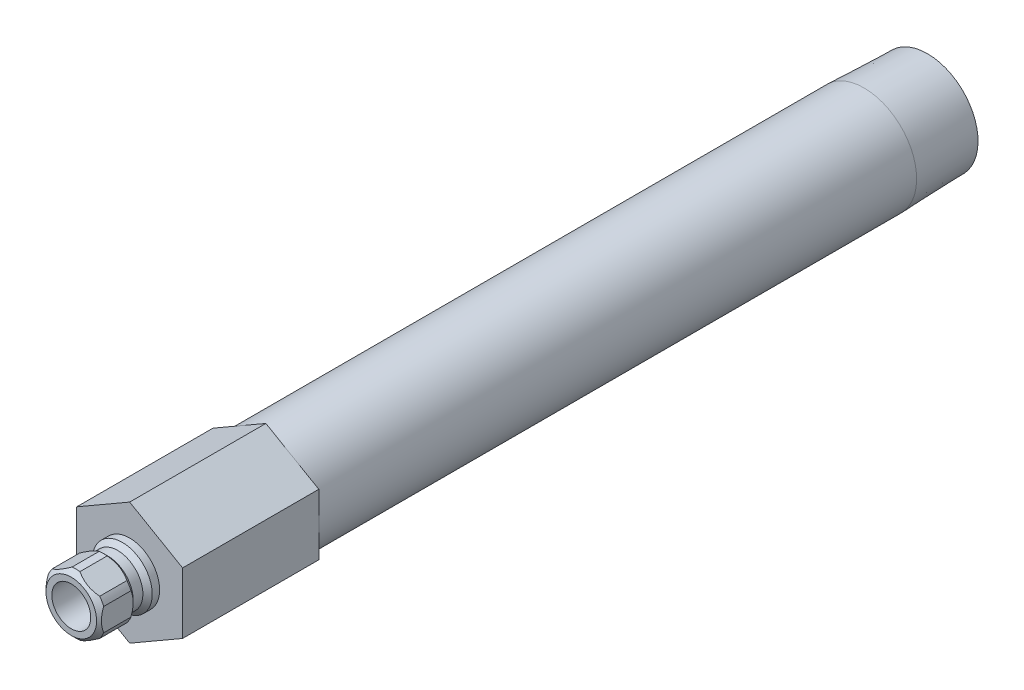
ISO-10303-21;
HEADER;
FILE_DESCRIPTION(('STEP AP214'),'2;1');
FILE_NAME('part.step','',(''),(''),'','','');
FILE_SCHEMA(('AUTOMOTIVE_DESIGN { 1 0 10303 214 1 1 1 1 }'));
ENDSEC;
DATA;
#1=APPLICATION_CONTEXT('core data for automotive mechanical design processes');
#2=APPLICATION_PROTOCOL_DEFINITION('international standard','automotive_design',2000,#1);
#3=PRODUCT_CONTEXT('',#1,'mechanical');
#4=PRODUCT('Part','Part','',(#3));
#5=PRODUCT_RELATED_PRODUCT_CATEGORY('part','',(#4));
#6=PRODUCT_DEFINITION_FORMATION('','',#4);
#7=PRODUCT_DEFINITION_CONTEXT('part definition',#1,'design');
#8=PRODUCT_DEFINITION('design','',#6,#7);
#9=PRODUCT_DEFINITION_SHAPE('','',#8);
#10=(LENGTH_UNIT() NAMED_UNIT(*) SI_UNIT(.MILLI.,.METRE.));
#11=(NAMED_UNIT(*) PLANE_ANGLE_UNIT() SI_UNIT($,.RADIAN.));
#12=(NAMED_UNIT(*) SI_UNIT($,.STERADIAN.) SOLID_ANGLE_UNIT());
#13=UNCERTAINTY_MEASURE_WITH_UNIT(LENGTH_MEASURE(1.E-05),#10,'distance_accuracy_value','');
#14=(GEOMETRIC_REPRESENTATION_CONTEXT(3) GLOBAL_UNCERTAINTY_ASSIGNED_CONTEXT((#13)) GLOBAL_UNIT_ASSIGNED_CONTEXT((#10,
#11,#12)) REPRESENTATION_CONTEXT('',''));
#15=CARTESIAN_POINT('',(0.,0.,0.));
#16=DIRECTION('',(0.,0.,1.));
#17=DIRECTION('',(1.,0.,0.));
#18=AXIS2_PLACEMENT_3D('',#15,#16,#17);
#19=CARTESIAN_POINT('',(0.,0.,0.));
#20=DIRECTION('',(0.,0.,-1.));
#21=DIRECTION('',(0.,1.,0.));
#22=AXIS2_PLACEMENT_3D('',#19,#20,#21);
#23=CYLINDRICAL_SURFACE('',#22,4.8895);
#24=DIRECTION('',(0.,0.,-1.));
#25=VECTOR('',#24,1.);
#26=CARTESIAN_POINT('',(4.5212,1.86170910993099,0.));
#27=LINE('',#26,#25);
#28=CARTESIAN_POINT('',(4.5212,1.86170910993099,4.318));
#29=VERTEX_POINT('',#28);
#30=CARTESIAN_POINT('',(4.5212,1.86170910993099,8.763));
#31=VERTEX_POINT('',#30);
#32=EDGE_CURVE('E404',#29,#31,#27,.F.);
#33=ORIENTED_EDGE('',*,*,#32,.F.);
#34=CARTESIAN_POINT('',(0.,0.,4.318));
#35=DIRECTION('',(0.,0.,-1.));
#36=DIRECTION('',(0.,1.,0.));
#37=AXIS2_PLACEMENT_3D('',#34,#35,#36);
#38=CIRCLE('',#37,4.8895);
#39=CARTESIAN_POINT('',(3.87288738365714,2.98461950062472,4.318));
#40=VERTEX_POINT('',#39);
#41=EDGE_CURVE('E206',#40,#29,#38,.T.);
#42=ORIENTED_EDGE('',*,*,#41,.F.);
#43=DIRECTION('',(0.,0.,-1.));
#44=VECTOR('',#43,1.);
#45=CARTESIAN_POINT('',(3.87288738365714,2.98461950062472,0.));
#46=LINE('',#45,#44);
#47=CARTESIAN_POINT('',(3.87288738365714,2.98461950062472,8.763));
#48=VERTEX_POINT('',#47);
#49=EDGE_CURVE('E392',#48,#40,#46,.T.);
#50=ORIENTED_EDGE('',*,*,#49,.F.);
#51=CARTESIAN_POINT('',(0.,0.,8.763));
#52=DIRECTION('',(0.,0.,-1.));
#53=DIRECTION('',(0.,1.,0.));
#54=AXIS2_PLACEMENT_3D('',#51,#52,#53);
#55=CIRCLE('',#54,4.8895);
#56=EDGE_CURVE('E193',#48,#31,#55,.T.);
#57=ORIENTED_EDGE('',*,*,#56,.T.);
#58=EDGE_LOOP('',(#33,#42,#50,#57));
#59=FACE_BOUND('',#58,.T.);
#60=ADVANCED_FACE('F34',(#59),#23,.T.);
#61=DIRECTION('',(0.,0.,-1.));
#62=VECTOR('',#61,1.);
#63=CARTESIAN_POINT('',(0.648312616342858,4.84632861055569,0.));
#64=LINE('',#63,#62);
#65=CARTESIAN_POINT('',(0.648312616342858,4.84632861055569,4.318));
#66=VERTEX_POINT('',#65);
#67=CARTESIAN_POINT('',(0.648312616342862,4.84632861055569,8.763));
#68=VERTEX_POINT('',#67);
#69=EDGE_CURVE('E311',#66,#68,#64,.F.);
#70=ORIENTED_EDGE('',*,*,#69,.F.);
#71=CARTESIAN_POINT('',(-0.648312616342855,4.84632861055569,4.318));
#72=VERTEX_POINT('',#71);
#73=EDGE_CURVE('E202',#72,#66,#38,.T.);
#74=ORIENTED_EDGE('',*,*,#73,.F.);
#75=DIRECTION('',(0.,0.,-1.));
#76=VECTOR('',#75,1.);
#77=CARTESIAN_POINT('',(-0.648312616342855,4.84632861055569,0.));
#78=LINE('',#77,#76);
#79=CARTESIAN_POINT('',(-0.648312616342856,4.84632861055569,8.763));
#80=VERTEX_POINT('',#79);
#81=EDGE_CURVE('E391',#80,#72,#78,.T.);
#82=ORIENTED_EDGE('',*,*,#81,.F.);
#83=EDGE_CURVE('E196',#80,#68,#55,.T.);
#84=ORIENTED_EDGE('',*,*,#83,.T.);
#85=EDGE_LOOP('',(#70,#74,#82,#84));
#86=FACE_BOUND('',#85,.T.);
#87=ADVANCED_FACE('F345',(#86),#23,.T.);
#88=DIRECTION('',(0.,0.,-1.));
#89=VECTOR('',#88,1.);
#90=CARTESIAN_POINT('',(-3.87288738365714,2.98461950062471,0.));
#91=LINE('',#90,#89);
#92=CARTESIAN_POINT('',(-3.87288738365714,2.98461950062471,4.318));
#93=VERTEX_POINT('',#92);
#94=CARTESIAN_POINT('',(-3.87288738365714,2.98461950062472,8.763));
#95=VERTEX_POINT('',#94);
#96=EDGE_CURVE('E54',#93,#95,#91,.F.);
#97=ORIENTED_EDGE('',*,*,#96,.F.);
#98=CARTESIAN_POINT('',(-4.5212,1.86170910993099,4.318));
#99=VERTEX_POINT('',#98);
#100=EDGE_CURVE('E205',#99,#93,#38,.T.);
#101=ORIENTED_EDGE('',*,*,#100,.F.);
#102=DIRECTION('',(0.,0.,-1.));
#103=VECTOR('',#102,1.);
#104=CARTESIAN_POINT('',(-4.5212,1.86170910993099,0.));
#105=LINE('',#104,#103);
#106=CARTESIAN_POINT('',(-4.5212,1.86170910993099,8.763));
#107=VERTEX_POINT('',#106);
#108=EDGE_CURVE('E378',#107,#99,#105,.T.);
#109=ORIENTED_EDGE('',*,*,#108,.F.);
#110=EDGE_CURVE('E195',#107,#95,#55,.T.);
#111=ORIENTED_EDGE('',*,*,#110,.T.);
#112=EDGE_LOOP('',(#97,#101,#109,#111));
#113=FACE_BOUND('',#112,.T.);
#114=ADVANCED_FACE('F350',(#113),#23,.T.);
#115=DIRECTION('',(0.,0.,-1.));
#116=VECTOR('',#115,1.);
#117=CARTESIAN_POINT('',(-4.5212,-1.86170910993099,0.));
#118=LINE('',#117,#116);
#119=CARTESIAN_POINT('',(-4.5212,-1.86170910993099,4.318));
#120=VERTEX_POINT('',#119);
#121=CARTESIAN_POINT('',(-4.5212,-1.86170910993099,8.763));
#122=VERTEX_POINT('',#121);
#123=EDGE_CURVE('E62',#120,#122,#118,.F.);
#124=ORIENTED_EDGE('',*,*,#123,.F.);
#125=CARTESIAN_POINT('',(-3.87288738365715,-2.98461950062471,4.318));
#126=VERTEX_POINT('',#125);
#127=EDGE_CURVE('E377',#126,#120,#38,.T.);
#128=ORIENTED_EDGE('',*,*,#127,.F.);
#129=DIRECTION('',(0.,0.,-1.));
#130=VECTOR('',#129,1.);
#131=CARTESIAN_POINT('',(-3.87288738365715,-2.98461950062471,0.));
#132=LINE('',#131,#130);
#133=CARTESIAN_POINT('',(-3.87288738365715,-2.98461950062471,8.763));
#134=VERTEX_POINT('',#133);
#135=EDGE_CURVE('E265',#134,#126,#132,.T.);
#136=ORIENTED_EDGE('',*,*,#135,.F.);
#137=EDGE_CURVE('E191',#134,#122,#55,.T.);
#138=ORIENTED_EDGE('',*,*,#137,.T.);
#139=EDGE_LOOP('',(#124,#128,#136,#138));
#140=FACE_BOUND('',#139,.T.);
#141=ADVANCED_FACE('F362',(#140),#23,.T.);
#142=DIRECTION('',(0.,0.,-1.));
#143=VECTOR('',#142,1.);
#144=CARTESIAN_POINT('',(-0.648312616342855,-4.84632861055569,0.));
#145=LINE('',#144,#143);
#146=CARTESIAN_POINT('',(-0.648312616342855,-4.84632861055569,4.318));
#147=VERTEX_POINT('',#146);
#148=CARTESIAN_POINT('',(-0.648312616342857,-4.84632861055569,8.763));
#149=VERTEX_POINT('',#148);
#150=EDGE_CURVE('E394',#147,#149,#145,.F.);
#151=ORIENTED_EDGE('',*,*,#150,.F.);
#152=CARTESIAN_POINT('',(0.648312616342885,-4.84632861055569,4.318));
#153=VERTEX_POINT('',#152);
#154=EDGE_CURVE('E183',#153,#147,#38,.T.);
#155=ORIENTED_EDGE('',*,*,#154,.F.);
#156=DIRECTION('',(0.,0.,-1.));
#157=VECTOR('',#156,1.);
#158=CARTESIAN_POINT('',(0.648312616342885,-4.84632861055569,0.));
#159=LINE('',#158,#157);
#160=CARTESIAN_POINT('',(0.648312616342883,-4.84632861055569,8.763));
#161=VERTEX_POINT('',#160);
#162=EDGE_CURVE('E165',#161,#153,#159,.T.);
#163=ORIENTED_EDGE('',*,*,#162,.F.);
#164=EDGE_CURVE('E181',#161,#149,#55,.T.);
#165=ORIENTED_EDGE('',*,*,#164,.T.);
#166=EDGE_LOOP('',(#151,#155,#163,#165));
#167=FACE_BOUND('',#166,.T.);
#168=ADVANCED_FACE('F180',(#167),#23,.T.);
#169=CARTESIAN_POINT('',(0.,0.,0.));
#170=DIRECTION('',(0.,0.,-1.));
#171=DIRECTION('',(0.,1.,0.));
#172=AXIS2_PLACEMENT_3D('',#169,#170,#171);
#173=CYLINDRICAL_SURFACE('',#172,8.57249999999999);
#174=CARTESIAN_POINT('',(0.,0.,-119.8372));
#175=DIRECTION('',(0.,0.,-1.));
#176=DIRECTION('',(0.,1.,0.));
#177=AXIS2_PLACEMENT_3D('',#174,#175,#176);
#178=CIRCLE('',#177,8.57249999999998);
#179=CARTESIAN_POINT('',(0.,8.5725,-119.8372));
#180=VERTEX_POINT('',#179);
#181=EDGE_CURVE('E219',#180,#180,#178,.T.);
#182=ORIENTED_EDGE('',*,*,#181,.F.);
#183=EDGE_LOOP('',(#182));
#184=FACE_BOUND('',#183,.T.);
#185=CARTESIAN_POINT('',(0.,0.,-22.225));
#186=DIRECTION('',(0.,0.,1.));
#187=DIRECTION('',(1.,0.,0.));
#188=AXIS2_PLACEMENT_3D('',#185,#186,#187);
#189=CIRCLE('',#188,8.57249999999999);
#190=CARTESIAN_POINT('',(8.57249999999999,0.,-22.225));
#191=VERTEX_POINT('',#190);
#192=EDGE_CURVE('E233',#191,#191,#189,.F.);
#193=ORIENTED_EDGE('',*,*,#192,.T.);
#194=EDGE_LOOP('',(#193));
#195=FACE_BOUND('',#194,.T.);
#196=ADVANCED_FACE('F361',(#184,#195),#173,.T.);
#197=CARTESIAN_POINT('',(0.,0.,0.));
#198=DIRECTION('',(0.,0.,-1.));
#199=DIRECTION('',(0.,1.,0.));
#200=AXIS2_PLACEMENT_3D('',#197,#198,#199);
#201=CYLINDRICAL_SURFACE('',#200,3.175);
#202=CARTESIAN_POINT('',(0.,0.,9.525));
#203=DIRECTION('',(0.,0.,-1.));
#204=DIRECTION('',(0.,1.,0.));
#205=AXIS2_PLACEMENT_3D('',#202,#203,#204);
#206=CIRCLE('',#205,3.175);
#207=CARTESIAN_POINT('',(0.,3.175,9.525));
#208=VERTEX_POINT('',#207);
#209=EDGE_CURVE('E235',#208,#208,#206,.T.);
#210=ORIENTED_EDGE('',*,*,#209,.F.);
#211=EDGE_LOOP('',(#210));
#212=FACE_BOUND('',#211,.T.);
#213=CARTESIAN_POINT('',(0.,0.,-22.225));
#214=DIRECTION('',(0.,0.,-1.));
#215=DIRECTION('',(0.,1.,0.));
#216=AXIS2_PLACEMENT_3D('',#213,#214,#215);
#217=CIRCLE('',#216,3.175);
#218=CARTESIAN_POINT('',(0.,3.175,-22.225));
#219=VERTEX_POINT('',#218);
#220=EDGE_CURVE('E174',#219,#219,#217,.T.);
#221=ORIENTED_EDGE('',*,*,#220,.T.);
#222=EDGE_LOOP('',(#221));
#223=FACE_BOUND('',#222,.T.);
#224=ADVANCED_FACE('F36',(#212,#223),#201,.F.);
#225=CARTESIAN_POINT('',(0.,3.175,-22.225));
#226=DIRECTION('',(0.,0.,-1.));
#227=DIRECTION('',(0.,1.,0.));
#228=AXIS2_PLACEMENT_3D('',#225,#226,#227);
#229=PLANE('',#228);
#230=CARTESIAN_POINT('',(0.,0.,-22.225));
#231=DIRECTION('',(0.,0.,-1.));
#232=DIRECTION('',(0.,1.,0.));
#233=AXIS2_PLACEMENT_3D('',#230,#231,#232);
#234=CIRCLE('',#233,6.2611);
#235=CARTESIAN_POINT('',(0.,6.2611,-22.225));
#236=VERTEX_POINT('',#235);
#237=EDGE_CURVE('E228',#236,#236,#234,.T.);
#238=ORIENTED_EDGE('',*,*,#237,.T.);
#239=EDGE_LOOP('',(#238));
#240=FACE_BOUND('',#239,.T.);
#241=ORIENTED_EDGE('',*,*,#220,.F.);
#242=EDGE_LOOP('',(#241));
#243=FACE_BOUND('',#242,.T.);
#244=ADVANCED_FACE('F533',(#240,#243),#229,.T.);
#245=CARTESIAN_POINT('',(0.,0.,0.));
#246=DIRECTION('',(0.,0.,-1.));
#247=DIRECTION('',(0.,1.,0.));
#248=AXIS2_PLACEMENT_3D('',#245,#246,#247);
#249=CYLINDRICAL_SURFACE('',#248,6.26109999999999);
#250=CARTESIAN_POINT('',(0.,0.,-130.175));
#251=DIRECTION('',(0.,0.,-1.));
#252=DIRECTION('',(0.,1.,0.));
#253=AXIS2_PLACEMENT_3D('',#250,#251,#252);
#254=CIRCLE('',#253,6.26109999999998);
#255=CARTESIAN_POINT('',(0.,6.2611,-130.175));
#256=VERTEX_POINT('',#255);
#257=EDGE_CURVE('E225',#256,#256,#254,.T.);
#258=ORIENTED_EDGE('',*,*,#257,.T.);
#259=EDGE_LOOP('',(#258));
#260=FACE_BOUND('',#259,.T.);
#261=ORIENTED_EDGE('',*,*,#237,.F.);
#262=EDGE_LOOP('',(#261));
#263=FACE_BOUND('',#262,.T.);
#264=ADVANCED_FACE('F530',(#260,#263),#249,.F.);
#265=CARTESIAN_POINT('',(0.,8.24944566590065,-130.175));
#266=DIRECTION('',(0.,0.,-1.));
#267=DIRECTION('',(0.,1.,0.));
#268=AXIS2_PLACEMENT_3D('',#265,#266,#267);
#269=PLANE('',#268);
#270=CARTESIAN_POINT('',(0.,0.,-130.175));
#271=DIRECTION('',(0.,0.,-1.));
#272=DIRECTION('',(0.,1.,0.));
#273=AXIS2_PLACEMENT_3D('',#270,#271,#272);
#274=CIRCLE('',#273,8.24944566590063);
#275=CARTESIAN_POINT('',(0.,8.24944566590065,-130.175));
#276=VERTEX_POINT('',#275);
#277=EDGE_CURVE('E222',#276,#276,#274,.T.);
#278=ORIENTED_EDGE('',*,*,#277,.T.);
#279=EDGE_LOOP('',(#278));
#280=FACE_BOUND('',#279,.T.);
#281=ORIENTED_EDGE('',*,*,#257,.F.);
#282=EDGE_LOOP('',(#281));
#283=FACE_BOUND('',#282,.T.);
#284=ADVANCED_FACE('F524',(#280,#283),#269,.T.);
#285=CARTESIAN_POINT('',(0.,0.,-130.175));
#286=DIRECTION('',(0.,0.,1.));
#287=DIRECTION('',(0.,-1.,0.));
#288=AXIS2_PLACEMENT_3D('',#285,#286,#287);
#289=CONICAL_SURFACE('',#288,8.24944566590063,0.0312396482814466);
#290=ORIENTED_EDGE('',*,*,#181,.T.);
#291=EDGE_LOOP('',(#290));
#292=FACE_BOUND('',#291,.T.);
#293=ORIENTED_EDGE('',*,*,#277,.F.);
#294=EDGE_LOOP('',(#293));
#295=FACE_BOUND('',#294,.T.);
#296=ADVANCED_FACE('F514',(#292,#295),#289,.T.);
#297=CARTESIAN_POINT('',(0.,4.8895,0.));
#298=DIRECTION('',(0.,0.,1.));
#299=DIRECTION('',(0.,-1.,0.));
#300=AXIS2_PLACEMENT_3D('',#297,#298,#299);
#301=PLANE('',#300);
#302=CARTESIAN_POINT('',(0.,0.,0.));
#303=DIRECTION('',(0.,0.,-1.));
#304=DIRECTION('',(0.,1.,0.));
#305=AXIS2_PLACEMENT_3D('',#302,#303,#304);
#306=CIRCLE('',#305,4.8895);
#307=CARTESIAN_POINT('',(0.,4.8895,0.));
#308=VERTEX_POINT('',#307);
#309=EDGE_CURVE('E216',#308,#308,#306,.T.);
#310=ORIENTED_EDGE('',*,*,#309,.T.);
#311=EDGE_LOOP('',(#310));
#312=FACE_BOUND('',#311,.T.);
#313=DIRECTION('',(-0.866025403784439,-0.5,0.));
#314=VECTOR('',#313,1.);
#315=CARTESIAN_POINT('',(0.,9.97199384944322,0.));
#316=LINE('',#315,#314);
#317=CARTESIAN_POINT('',(0.,9.97199384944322,0.));
#318=VERTEX_POINT('',#317);
#319=CARTESIAN_POINT('',(-8.636,4.98599692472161,0.));
#320=VERTEX_POINT('',#319);
#321=EDGE_CURVE('E409',#318,#320,#316,.T.);
#322=ORIENTED_EDGE('',*,*,#321,.T.);
#323=DIRECTION('',(0.,-1.,0.));
#324=VECTOR('',#323,1.);
#325=CARTESIAN_POINT('',(-8.636,4.98599692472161,0.));
#326=LINE('',#325,#324);
#327=CARTESIAN_POINT('',(-8.636,-4.98599692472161,0.));
#328=VERTEX_POINT('',#327);
#329=EDGE_CURVE('E436',#320,#328,#326,.T.);
#330=ORIENTED_EDGE('',*,*,#329,.T.);
#331=DIRECTION('',(0.866025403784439,-0.5,0.));
#332=VECTOR('',#331,1.);
#333=CARTESIAN_POINT('',(-8.636,-4.98599692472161,0.));
#334=LINE('',#333,#332);
#335=CARTESIAN_POINT('',(0.,-9.97199384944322,0.));
#336=VERTEX_POINT('',#335);
#337=EDGE_CURVE('E439',#328,#336,#334,.T.);
#338=ORIENTED_EDGE('',*,*,#337,.T.);
#339=DIRECTION('',(0.866025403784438,0.5,0.));
#340=VECTOR('',#339,1.);
#341=CARTESIAN_POINT('',(0.,-9.97199384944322,0.));
#342=LINE('',#341,#340);
#343=CARTESIAN_POINT('',(8.636,-4.98599692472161,0.));
#344=VERTEX_POINT('',#343);
#345=EDGE_CURVE('E442',#336,#344,#342,.T.);
#346=ORIENTED_EDGE('',*,*,#345,.T.);
#347=DIRECTION('',(0.,1.,0.));
#348=VECTOR('',#347,1.);
#349=CARTESIAN_POINT('',(8.636,-4.98599692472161,0.));
#350=LINE('',#349,#348);
#351=CARTESIAN_POINT('',(8.636,4.98599692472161,0.));
#352=VERTEX_POINT('',#351);
#353=EDGE_CURVE('E445',#344,#352,#350,.T.);
#354=ORIENTED_EDGE('',*,*,#353,.T.);
#355=DIRECTION('',(-0.866025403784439,0.5,0.));
#356=VECTOR('',#355,1.);
#357=CARTESIAN_POINT('',(8.636,4.98599692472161,0.));
#358=LINE('',#357,#356);
#359=EDGE_CURVE('E418',#352,#318,#358,.T.);
#360=ORIENTED_EDGE('',*,*,#359,.T.);
#361=EDGE_LOOP('',(#322,#330,#338,#346,#354,#360));
#362=FACE_BOUND('',#361,.T.);
#363=ADVANCED_FACE('F511',(#312,#362),#301,.T.);
#364=CARTESIAN_POINT('',(0.,0.,0.));
#365=DIRECTION('',(0.,0.,-1.));
#366=DIRECTION('',(0.,1.,0.));
#367=AXIS2_PLACEMENT_3D('',#364,#365,#366);
#368=CYLINDRICAL_SURFACE('',#367,4.8895);
#369=CARTESIAN_POINT('',(0.,0.,1.2065));
#370=DIRECTION('',(0.,0.,-1.));
#371=DIRECTION('',(0.,1.,0.));
#372=AXIS2_PLACEMENT_3D('',#369,#370,#371);
#373=CIRCLE('',#372,4.8895);
#374=CARTESIAN_POINT('',(0.,4.8895,1.2065));
#375=VERTEX_POINT('',#374);
#376=EDGE_CURVE('E213',#375,#375,#373,.T.);
#377=ORIENTED_EDGE('',*,*,#376,.T.);
#378=EDGE_LOOP('',(#377));
#379=FACE_BOUND('',#378,.T.);
#380=ORIENTED_EDGE('',*,*,#309,.F.);
#381=EDGE_LOOP('',(#380));
#382=FACE_BOUND('',#381,.T.);
#383=ADVANCED_FACE('F513',(#379,#382),#368,.T.);
#384=CARTESIAN_POINT('',(0.,0.,1.2065));
#385=DIRECTION('',(0.,0.,-1.));
#386=DIRECTION('',(0.,1.,0.));
#387=AXIS2_PLACEMENT_3D('',#384,#385,#386);
#388=CONICAL_SURFACE('',#387,4.8895,0.785398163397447);
#389=CARTESIAN_POINT('',(0.,0.,1.9685));
#390=DIRECTION('',(0.,0.,-1.));
#391=DIRECTION('',(0.,1.,0.));
#392=AXIS2_PLACEMENT_3D('',#389,#390,#391);
#393=CIRCLE('',#392,4.1275);
#394=CARTESIAN_POINT('',(0.,4.1275,1.9685));
#395=VERTEX_POINT('',#394);
#396=EDGE_CURVE('E210',#395,#395,#393,.T.);
#397=ORIENTED_EDGE('',*,*,#396,.T.);
#398=EDGE_LOOP('',(#397));
#399=FACE_BOUND('',#398,.T.);
#400=ORIENTED_EDGE('',*,*,#376,.F.);
#401=EDGE_LOOP('',(#400));
#402=FACE_BOUND('',#401,.T.);
#403=ADVANCED_FACE('F521',(#399,#402),#388,.T.);
#404=CARTESIAN_POINT('',(0.,0.,0.));
#405=DIRECTION('',(0.,0.,-1.));
#406=DIRECTION('',(0.,1.,0.));
#407=AXIS2_PLACEMENT_3D('',#404,#405,#406);
#408=CYLINDRICAL_SURFACE('',#407,4.1275);
#409=CARTESIAN_POINT('',(0.,0.,3.556));
#410=DIRECTION('',(0.,0.,-1.));
#411=DIRECTION('',(0.,1.,0.));
#412=AXIS2_PLACEMENT_3D('',#409,#410,#411);
#413=CIRCLE('',#412,4.1275);
#414=CARTESIAN_POINT('',(0.,4.1275,3.556));
#415=VERTEX_POINT('',#414);
#416=EDGE_CURVE('E207',#415,#415,#413,.T.);
#417=ORIENTED_EDGE('',*,*,#416,.T.);
#418=EDGE_LOOP('',(#417));
#419=FACE_BOUND('',#418,.T.);
#420=ORIENTED_EDGE('',*,*,#396,.F.);
#421=EDGE_LOOP('',(#420));
#422=FACE_BOUND('',#421,.T.);
#423=ADVANCED_FACE('F272',(#419,#422),#408,.T.);
#424=CARTESIAN_POINT('',(0.,0.,3.556));
#425=DIRECTION('',(0.,0.,1.));
#426=DIRECTION('',(0.,-1.,0.));
#427=AXIS2_PLACEMENT_3D('',#424,#425,#426);
#428=CONICAL_SURFACE('',#427,4.1275,0.785398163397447);
#429=CARTESIAN_POINT('',(4.52119999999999,-5.15925306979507,6.28846659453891));
#430=CARTESIAN_POINT('',(4.52119999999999,-5.03341781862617,6.19384981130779));
#431=CARTESIAN_POINT('',(4.52119999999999,-4.90687282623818,6.100161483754));
#432=CARTESIAN_POINT('',(4.52119999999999,-4.65208542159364,5.91505573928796));
#433=CARTESIAN_POINT('',(4.52119999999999,-4.52384258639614,5.8236389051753));
#434=CARTESIAN_POINT('',(4.52119999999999,-4.26444371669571,5.64284060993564));
#435=CARTESIAN_POINT('',(4.52119999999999,-4.1332728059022,5.5534804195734));
#436=CARTESIAN_POINT('',(4.52119999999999,-3.86869655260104,5.37814219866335));
#437=CARTESIAN_POINT('',(4.52119999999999,-3.73529136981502,5.29216392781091));
#438=CARTESIAN_POINT('',(4.52119999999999,-3.45835736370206,5.11964219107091));
#439=CARTESIAN_POINT('',(4.52119999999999,-3.31467977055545,5.03333631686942));
#440=CARTESIAN_POINT('',(4.52119999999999,-3.02397608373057,4.86646929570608));
#441=CARTESIAN_POINT('',(4.52119999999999,-2.87694947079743,4.78590904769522));
#442=CARTESIAN_POINT('',(4.52119999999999,-2.57957206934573,4.6322757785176));
#443=CARTESIAN_POINT('',(4.52119999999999,-2.42923274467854,4.55918074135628));
#444=CARTESIAN_POINT('',(4.52119999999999,-2.12448469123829,4.4221138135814));
#445=CARTESIAN_POINT('',(4.52119999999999,-1.97007782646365,4.35813782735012));
#446=CARTESIAN_POINT('',(4.52119999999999,-1.66898205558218,4.24604782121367));
#447=CARTESIAN_POINT('',(4.52119999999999,-1.52260919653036,4.19709368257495));
#448=CARTESIAN_POINT('',(4.52119999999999,-1.22638031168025,4.11093488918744));
#449=CARTESIAN_POINT('',(4.52119999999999,-1.07652404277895,4.07373105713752));
#450=CARTESIAN_POINT('',(4.52119999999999,-0.776693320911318,4.01362130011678));
#451=CARTESIAN_POINT('',(4.52119999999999,-0.626768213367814,3.99047322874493));
#452=CARTESIAN_POINT('',(4.52119999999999,-0.325366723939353,3.95891692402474));
#453=CARTESIAN_POINT('',(4.52119999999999,-0.173890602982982,3.95050625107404));
#454=CARTESIAN_POINT('',(4.52119999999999,0.123852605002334,3.94903068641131));
#455=CARTESIAN_POINT('',(4.52119999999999,0.270117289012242,3.95544130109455));
#456=CARTESIAN_POINT('',(4.52119999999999,0.561370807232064,3.98210770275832));
#457=CARTESIAN_POINT('',(4.5212,0.706359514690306,4.0023648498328));
#458=CARTESIAN_POINT('',(4.5212,0.996462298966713,4.05597163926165));
#459=CARTESIAN_POINT('',(4.5212,1.14153485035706,4.08954247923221));
#460=CARTESIAN_POINT('',(4.5212,1.42852462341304,4.1680002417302));
#461=CARTESIAN_POINT('',(4.5212,1.57044212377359,4.21288616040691));
#462=CARTESIAN_POINT('',(4.5212,1.86505501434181,4.31714129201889));
#463=CARTESIAN_POINT('',(4.5212,2.01739126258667,4.377515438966));
#464=CARTESIAN_POINT('',(4.5212,2.31809735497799,4.50751823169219));
#465=CARTESIAN_POINT('',(4.5212,2.46646529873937,4.57715121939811));
#466=CARTESIAN_POINT('',(4.5212,2.75996557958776,4.72401353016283));
#467=CARTESIAN_POINT('',(4.5212,2.9050858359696,4.80126680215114));
#468=CARTESIAN_POINT('',(4.5212,3.19198335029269,4.96166050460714));
#469=CARTESIAN_POINT('',(4.5212,3.33376113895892,5.04479999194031));
#470=CARTESIAN_POINT('',(4.5212,3.60742153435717,5.21154136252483));
#471=CARTESIAN_POINT('',(4.5212,3.73944496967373,5.29491333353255));
#472=CARTESIAN_POINT('',(4.5212,4.00122581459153,5.46515273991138));
#473=CARTESIAN_POINT('',(4.5212,4.13098305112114,5.55202044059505));
#474=CARTESIAN_POINT('',(4.5212,4.38747396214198,5.72790624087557));
#475=CARTESIAN_POINT('',(4.5212,4.51422365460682,5.81690106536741));
#476=CARTESIAN_POINT('',(4.5212,4.76599253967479,5.99723636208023));
#477=CARTESIAN_POINT('',(4.5212,4.89101219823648,6.08857618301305));
#478=CARTESIAN_POINT('',(4.5212,5.0153077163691,6.18087446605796));
#479=B_SPLINE_CURVE_WITH_KNOTS('',3,(#429,#430,#431,#432,#433,#434,#435,#436,#437,#438,#439,
#440,#441,#442,#443,#444,#445,#446,#447,#448,#449,#450,#451,#452,#453,#454,#455,#456,#457,#458,
#459,#460,#461,#462,#463,#464,#465,#466,#467,#468,#469,#470,#471,#472,#473,#474,#475,#476,#477,
#478),.UNSPECIFIED.,.F.,.F.,(4,2,2,2,2,2,2,2,2,2,2,2,2,2,2,2,2,2,2,2,2,2,2,2,4),(0.,
0.472324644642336,0.944769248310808,1.42087610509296,1.89694907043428,2.39966187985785,
2.90245317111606,3.40371602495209,3.90475303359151,4.36737130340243,4.83002195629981,
5.28445770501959,5.73881822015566,6.17734710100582,6.61591906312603,7.06210522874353,
7.5082518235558,7.99945943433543,8.49089821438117,8.98393391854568,9.4768908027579,
9.94525924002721,10.4136632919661,10.8782525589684,11.3427141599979),.UNSPECIFIED.);
#480=CARTESIAN_POINT('',(4.52119999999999,-1.861709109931,4.318));
#481=VERTEX_POINT('',#480);
#482=EDGE_CURVE('E407',#481,#29,#479,.T.);
#483=ORIENTED_EDGE('',*,*,#482,.F.);
#484=CARTESIAN_POINT('',(3.87288738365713,-2.98461950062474,4.318));
#485=VERTEX_POINT('',#484);
#486=EDGE_CURVE('E385',#481,#485,#38,.T.);
#487=ORIENTED_EDGE('',*,*,#486,.T.);
#488=CARTESIAN_POINT('',(0.647857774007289,-4.84659121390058,4.3182));
#489=CARTESIAN_POINT('',(0.775261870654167,-4.77303442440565,4.26213711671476));
#490=CARTESIAN_POINT('',(0.904457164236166,-4.69844348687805,4.21102627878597));
#491=CARTESIAN_POINT('',(1.16629518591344,-4.5472712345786,4.1207431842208));
#492=CARTESIAN_POINT('',(1.29894624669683,-4.47068510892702,4.08160338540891));
#493=CARTESIAN_POINT('',(1.56203676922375,-4.31878972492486,4.01877592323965));
#494=CARTESIAN_POINT('',(1.69238331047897,-4.24353411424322,3.99458163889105));
#495=CARTESIAN_POINT('',(1.95434729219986,-4.09228913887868,3.96102228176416));
#496=CARTESIAN_POINT('',(2.08596281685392,-4.01630088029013,3.95163757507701));
#497=CARTESIAN_POINT('',(2.3562305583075,-3.86026172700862,3.94821923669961));
#498=CARTESIAN_POINT('',(2.49489129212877,-3.78020591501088,3.95501290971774));
#499=CARTESIAN_POINT('',(2.7710334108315,-3.62077518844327,3.9851849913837));
#500=CARTESIAN_POINT('',(2.90851272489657,-3.5414014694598,4.00858815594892));
#501=CARTESIAN_POINT('',(3.18622016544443,-3.38106700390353,4.07155129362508));
#502=CARTESIAN_POINT('',(3.32634361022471,-3.30016669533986,4.11171074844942));
#503=CARTESIAN_POINT('',(3.60275664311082,-3.14057955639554,4.20550294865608));
#504=CARTESIAN_POINT('',(3.73905611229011,-3.06188702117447,4.25909654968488));
#505=CARTESIAN_POINT('',(3.87334222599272,-2.98435689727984,4.3182));
#506=B_SPLINE_CURVE_WITH_KNOTS('',3,(#488,#489,#490,#491,#492,#493,#494,#495,#496,#497,#498,
#499,#500,#501,#502,#503,#504,#505),.UNSPECIFIED.,.F.,.F.,(4,2,2,2,2,2,2,2,4),(0.,
0.472469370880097,0.946208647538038,1.40285320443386,1.85889185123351,2.33874707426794,
2.81931901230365,3.31879975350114,3.81684169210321),.UNSPECIFIED.);
#507=EDGE_CURVE('E258',#153,#485,#506,.T.);
#508=ORIENTED_EDGE('',*,*,#507,.F.);
#509=ORIENTED_EDGE('',*,*,#154,.T.);
#510=CARTESIAN_POINT('',(-3.87334222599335,-2.98435689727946,4.31820000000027));
#511=CARTESIAN_POINT('',(-3.74593812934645,-3.05791368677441,4.262137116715));
#512=CARTESIAN_POINT('',(-3.61674283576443,-3.13250462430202,4.21102627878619));
#513=CARTESIAN_POINT('',(-3.35490481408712,-3.2836768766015,4.12074318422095));
#514=CARTESIAN_POINT('',(-3.2222537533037,-3.36026300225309,4.08160338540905));
#515=CARTESIAN_POINT('',(-2.95916323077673,-3.51215838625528,4.01877592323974));
#516=CARTESIAN_POINT('',(-2.82881668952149,-3.58741399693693,3.99458163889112));
#517=CARTESIAN_POINT('',(-2.56685270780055,-3.73865897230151,3.96102228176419));
#518=CARTESIAN_POINT('',(-2.43523718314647,-3.81464723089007,3.95163757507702));
#519=CARTESIAN_POINT('',(-2.16496944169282,-3.97068638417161,3.94821923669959));
#520=CARTESIAN_POINT('',(-2.02630870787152,-4.05074219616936,3.9550129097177));
#521=CARTESIAN_POINT('',(-1.75016658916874,-4.21017292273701,3.98518499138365));
#522=CARTESIAN_POINT('',(-1.61268727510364,-4.2895466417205,4.00858815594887));
#523=CARTESIAN_POINT('',(-1.33497983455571,-4.44988110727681,4.07155129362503));
#524=CARTESIAN_POINT('',(-1.1948563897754,-4.5307814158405,4.11171074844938));
#525=CARTESIAN_POINT('',(-0.918443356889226,-4.69036855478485,4.20550294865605));
#526=CARTESIAN_POINT('',(-0.782143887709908,-4.76906109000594,4.25909654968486));
#527=CARTESIAN_POINT('',(-0.647857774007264,-4.84659121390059,4.3182));
#528=B_SPLINE_CURVE_WITH_KNOTS('',3,(#510,#511,#512,#513,#514,#515,#516,#517,#518,#519,#520,
#521,#522,#523,#524,#525,#526,#527),.UNSPECIFIED.,.F.,.F.,(4,2,2,2,2,2,2,2,4),(0.,
0.472469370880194,0.946208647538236,1.40285320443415,1.85889185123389,2.33874707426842,
2.81931901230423,3.31879975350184,3.81684169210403),.UNSPECIFIED.);
#529=EDGE_CURVE('E281',#126,#147,#528,.T.);
#530=ORIENTED_EDGE('',*,*,#529,.F.);
#531=ORIENTED_EDGE('',*,*,#127,.T.);
#532=CARTESIAN_POINT('',(-4.5212,-5.15925306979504,6.2884665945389));
#533=CARTESIAN_POINT('',(-4.5212,-5.03341781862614,6.19384981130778));
#534=CARTESIAN_POINT('',(-4.5212,-4.90687282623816,6.10016148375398));
#535=CARTESIAN_POINT('',(-4.5212,-4.65208542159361,5.91505573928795));
#536=CARTESIAN_POINT('',(-4.5212,-4.52384258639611,5.82363890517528));
#537=CARTESIAN_POINT('',(-4.5212,-4.26444371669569,5.64284060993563));
#538=CARTESIAN_POINT('',(-4.5212,-4.13327280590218,5.55348041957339));
#539=CARTESIAN_POINT('',(-4.5212,-3.86869655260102,5.37814219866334));
#540=CARTESIAN_POINT('',(-4.5212,-3.735291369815,5.2921639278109));
#541=CARTESIAN_POINT('',(-4.5212,-3.45835736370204,5.1196421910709));
#542=CARTESIAN_POINT('',(-4.5212,-3.31467977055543,5.03333631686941));
#543=CARTESIAN_POINT('',(-4.5212,-3.02397608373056,4.86646929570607));
#544=CARTESIAN_POINT('',(-4.5212,-2.87694947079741,4.78590904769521));
#545=CARTESIAN_POINT('',(-4.5212,-2.57957206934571,4.63227577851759));
#546=CARTESIAN_POINT('',(-4.5212,-2.42923274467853,4.55918074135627));
#547=CARTESIAN_POINT('',(-4.5212,-2.12448469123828,4.4221138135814));
#548=CARTESIAN_POINT('',(-4.5212,-1.97007782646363,4.35813782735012));
#549=CARTESIAN_POINT('',(-4.5212,-1.66898205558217,4.24604782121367));
#550=CARTESIAN_POINT('',(-4.5212,-1.52260919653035,4.19709368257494));
#551=CARTESIAN_POINT('',(-4.5212,-1.22638031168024,4.11093488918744));
#552=CARTESIAN_POINT('',(-4.5212,-1.07652404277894,4.07373105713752));
#553=CARTESIAN_POINT('',(-4.5212,-0.776693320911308,4.01362130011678));
#554=CARTESIAN_POINT('',(-4.5212,-0.626768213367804,3.99047322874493));
#555=CARTESIAN_POINT('',(-4.5212,-0.325366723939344,3.95891692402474));
#556=CARTESIAN_POINT('',(-4.5212,-0.173890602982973,3.95050625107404));
#557=CARTESIAN_POINT('',(-4.5212,0.123852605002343,3.94903068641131));
#558=CARTESIAN_POINT('',(-4.5212,0.270117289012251,3.95544130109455));
#559=CARTESIAN_POINT('',(-4.5212,0.561370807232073,3.98210770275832));
#560=CARTESIAN_POINT('',(-4.5212,0.706359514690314,4.0023648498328));
#561=CARTESIAN_POINT('',(-4.5212,0.996462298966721,4.05597163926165));
#562=CARTESIAN_POINT('',(-4.5212,1.14153485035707,4.08954247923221));
#563=CARTESIAN_POINT('',(-4.5212,1.42852462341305,4.16800024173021));
#564=CARTESIAN_POINT('',(-4.5212,1.5704421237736,4.21288616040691));
#565=CARTESIAN_POINT('',(-4.5212,1.86505501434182,4.31714129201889));
#566=CARTESIAN_POINT('',(-4.5212,2.01739126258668,4.377515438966));
#567=CARTESIAN_POINT('',(-4.5212,2.318097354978,4.50751823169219));
#568=CARTESIAN_POINT('',(-4.5212,2.46646529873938,4.57715121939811));
#569=CARTESIAN_POINT('',(-4.5212,2.75996557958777,4.72401353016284));
#570=CARTESIAN_POINT('',(-4.5212,2.9050858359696,4.80126680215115));
#571=CARTESIAN_POINT('',(-4.5212,3.1919833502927,4.96166050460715));
#572=CARTESIAN_POINT('',(-4.5212,3.33376113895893,5.04479999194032));
#573=CARTESIAN_POINT('',(-4.5212,3.60742153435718,5.21154136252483));
#574=CARTESIAN_POINT('',(-4.5212,3.73944496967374,5.29491333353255));
#575=CARTESIAN_POINT('',(-4.5212,4.00122581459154,5.46515273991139));
#576=CARTESIAN_POINT('',(-4.5212,4.13098305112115,5.55202044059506));
#577=CARTESIAN_POINT('',(-4.5212,4.38747396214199,5.72790624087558));
#578=CARTESIAN_POINT('',(-4.5212,4.51422365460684,5.81690106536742));
#579=CARTESIAN_POINT('',(-4.5212,4.76599253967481,5.99723636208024));
#580=CARTESIAN_POINT('',(-4.5212,4.89101219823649,6.08857618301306));
#581=CARTESIAN_POINT('',(-4.5212,5.01530771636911,6.18087446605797));
#582=B_SPLINE_CURVE_WITH_KNOTS('',3,(#532,#533,#534,#535,#536,#537,#538,#539,#540,#541,#542,
#543,#544,#545,#546,#547,#548,#549,#550,#551,#552,#553,#554,#555,#556,#557,#558,#559,#560,#561,
#562,#563,#564,#565,#566,#567,#568,#569,#570,#571,#572,#573,#574,#575,#576,#577,#578,#579,#580,
#581),.UNSPECIFIED.,.F.,.F.,(4,2,2,2,2,2,2,2,2,2,2,2,2,2,2,2,2,2,2,2,2,2,2,2,4),(0.,
0.472324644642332,0.944769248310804,1.42087610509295,1.89694907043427,2.39966187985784,
2.90245317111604,3.40371602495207,3.90475303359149,4.36737130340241,4.83002195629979,
5.28445770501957,5.73881822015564,6.1773471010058,6.615919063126,7.06210522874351,
7.50825182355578,7.9994594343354,8.49089821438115,8.98393391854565,9.47689080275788,
9.94525924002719,10.4136632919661,10.8782525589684,11.3427141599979),.UNSPECIFIED.);
#583=EDGE_CURVE('E288',#99,#120,#582,.F.);
#584=ORIENTED_EDGE('',*,*,#583,.F.);
#585=ORIENTED_EDGE('',*,*,#100,.T.);
#586=CARTESIAN_POINT('',(-0.647857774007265,4.84659121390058,4.3182));
#587=CARTESIAN_POINT('',(-0.775261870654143,4.77303442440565,4.26213711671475));
#588=CARTESIAN_POINT('',(-0.904457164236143,4.69844348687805,4.21102627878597));
#589=CARTESIAN_POINT('',(-1.16629518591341,4.5472712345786,4.12074318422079));
#590=CARTESIAN_POINT('',(-1.2989462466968,4.47068510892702,4.08160338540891));
#591=CARTESIAN_POINT('',(-1.56203676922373,4.31878972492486,4.01877592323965));
#592=CARTESIAN_POINT('',(-1.69238331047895,4.24353411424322,3.99458163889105));
#593=CARTESIAN_POINT('',(-1.95434729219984,4.09228913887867,3.96102228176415));
#594=CARTESIAN_POINT('',(-2.0859628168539,4.01630088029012,3.95163757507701));
#595=CARTESIAN_POINT('',(-2.35623055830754,3.86026172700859,3.9482192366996));
#596=CARTESIAN_POINT('',(-2.49489129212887,3.78020591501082,3.95501290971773));
#597=CARTESIAN_POINT('',(-2.7710334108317,3.62077518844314,3.98518499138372));
#598=CARTESIAN_POINT('',(-2.90851272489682,3.54140146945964,4.00858815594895));
#599=CARTESIAN_POINT('',(-3.18622016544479,3.38106700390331,4.07155129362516));
#600=CARTESIAN_POINT('',(-3.32634361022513,3.3001666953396,4.11171074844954));
#601=CARTESIAN_POINT('',(-3.60275664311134,3.14057955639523,4.20550294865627));
#602=CARTESIAN_POINT('',(-3.73905611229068,3.06188702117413,4.2590965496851));
#603=CARTESIAN_POINT('',(-3.87334222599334,2.98435689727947,4.31820000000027));
#604=B_SPLINE_CURVE_WITH_KNOTS('',3,(#586,#587,#588,#589,#590,#591,#592,#593,#594,#595,#596,
#597,#598,#599,#600,#601,#602,#603),.UNSPECIFIED.,.F.,.F.,(4,2,2,2,2,2,2,2,4),(0.,
0.472469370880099,0.946208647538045,1.40285320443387,1.85889185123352,2.33874707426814,
2.81931901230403,3.31879975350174,3.81684169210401),.UNSPECIFIED.);
#605=EDGE_CURVE('E295',#72,#93,#604,.T.);
#606=ORIENTED_EDGE('',*,*,#605,.F.);
#607=ORIENTED_EDGE('',*,*,#73,.T.);
#608=CARTESIAN_POINT('',(3.87334222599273,2.98435689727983,4.3182));
#609=CARTESIAN_POINT('',(3.74593812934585,3.05791368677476,4.26213711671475));
#610=CARTESIAN_POINT('',(3.61674283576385,3.13250462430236,4.21102627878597));
#611=CARTESIAN_POINT('',(3.35490481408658,3.28367687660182,4.12074318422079));
#612=CARTESIAN_POINT('',(3.22225375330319,3.3602630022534,4.08160338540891));
#613=CARTESIAN_POINT('',(2.95916323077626,3.51215838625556,4.01877592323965));
#614=CARTESIAN_POINT('',(2.82881668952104,3.58741399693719,3.99458163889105));
#615=CARTESIAN_POINT('',(2.56685270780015,3.73865897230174,3.96102228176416));
#616=CARTESIAN_POINT('',(2.4352371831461,3.81464723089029,3.95163757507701));
#617=CARTESIAN_POINT('',(2.16496944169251,3.97068638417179,3.94821923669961));
#618=CARTESIAN_POINT('',(2.02630870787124,4.05074219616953,3.95501290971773));
#619=CARTESIAN_POINT('',(1.75016658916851,4.21017292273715,3.98518499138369));
#620=CARTESIAN_POINT('',(1.61268727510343,4.28954664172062,4.00858815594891));
#621=CARTESIAN_POINT('',(1.33497983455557,4.44988110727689,4.07155129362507));
#622=CARTESIAN_POINT('',(1.19485638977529,4.53078141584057,4.11171074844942));
#623=CARTESIAN_POINT('',(0.918443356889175,4.69036855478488,4.20550294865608));
#624=CARTESIAN_POINT('',(0.782143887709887,4.76906109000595,4.25909654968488));
#625=CARTESIAN_POINT('',(0.64785777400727,4.84659121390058,4.3182));
#626=B_SPLINE_CURVE_WITH_KNOTS('',3,(#608,#609,#610,#611,#612,#613,#614,#615,#616,#617,#618,
#619,#620,#621,#622,#623,#624,#625),.UNSPECIFIED.,.F.,.F.,(4,2,2,2,2,2,2,2,4),(0.,
0.472469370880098,0.946208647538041,1.40285320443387,1.85889185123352,2.33874707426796,
2.81931901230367,3.31879975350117,3.81684169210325),.UNSPECIFIED.);
#627=EDGE_CURVE('E303',#40,#66,#626,.T.);
#628=ORIENTED_EDGE('',*,*,#627,.F.);
#629=ORIENTED_EDGE('',*,*,#41,.T.);
#630=EDGE_LOOP('',(#483,#487,#508,#509,#530,#531,#584,#585,#606,#607,#628,#629));
#631=FACE_BOUND('',#630,.T.);
#632=ORIENTED_EDGE('',*,*,#416,.F.);
#633=EDGE_LOOP('',(#632));
#634=FACE_BOUND('',#633,.T.);
#635=ADVANCED_FACE('F267',(#631,#634),#428,.T.);
#636=DIRECTION('',(0.,0.,-1.));
#637=VECTOR('',#636,1.);
#638=CARTESIAN_POINT('',(4.52119999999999,-1.861709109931,0.));
#639=LINE('',#638,#637);
#640=CARTESIAN_POINT('',(4.52119999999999,-1.861709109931,8.763));
#641=VERTEX_POINT('',#640);
#642=EDGE_CURVE('E310',#641,#481,#639,.T.);
#643=ORIENTED_EDGE('',*,*,#642,.F.);
#644=CARTESIAN_POINT('',(3.87288738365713,-2.98461950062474,8.763));
#645=VERTEX_POINT('',#644);
#646=EDGE_CURVE('E190',#641,#645,#55,.T.);
#647=ORIENTED_EDGE('',*,*,#646,.T.);
#648=DIRECTION('',(0.,0.,-1.));
#649=VECTOR('',#648,1.);
#650=CARTESIAN_POINT('',(3.87288738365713,-2.98461950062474,0.));
#651=LINE('',#650,#649);
#652=EDGE_CURVE('E168',#485,#645,#651,.F.);
#653=ORIENTED_EDGE('',*,*,#652,.F.);
#654=ORIENTED_EDGE('',*,*,#486,.F.);
#655=EDGE_LOOP('',(#643,#647,#653,#654));
#656=FACE_BOUND('',#655,.T.);
#657=ADVANCED_FACE('F271',(#656),#23,.T.);
#658=CARTESIAN_POINT('',(0.,0.,8.763));
#659=DIRECTION('',(0.,0.,-1.));
#660=DIRECTION('',(0.,1.,0.));
#661=AXIS2_PLACEMENT_3D('',#658,#659,#660);
#662=CONICAL_SURFACE('',#661,4.8895,0.785398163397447);
#663=CARTESIAN_POINT('',(4.52119999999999,-5.15925306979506,6.79253340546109));
#664=CARTESIAN_POINT('',(4.52119999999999,-5.03341781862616,6.88715018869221));
#665=CARTESIAN_POINT('',(4.52119999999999,-4.90687282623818,6.980838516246));
#666=CARTESIAN_POINT('',(4.52119999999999,-4.65208542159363,7.16594426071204));
#667=CARTESIAN_POINT('',(4.52119999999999,-4.52384258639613,7.25736109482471));
#668=CARTESIAN_POINT('',(4.52119999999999,-4.2644437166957,7.43815939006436));
#669=CARTESIAN_POINT('',(4.52119999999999,-4.1332728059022,7.5275195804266));
#670=CARTESIAN_POINT('',(4.52119999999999,-3.86869655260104,7.70285780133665));
#671=CARTESIAN_POINT('',(4.52119999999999,-3.73529136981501,7.78883607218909));
#672=CARTESIAN_POINT('',(4.52119999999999,-3.45835736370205,7.9613578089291));
#673=CARTESIAN_POINT('',(4.52119999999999,-3.31467977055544,8.04766368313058));
#674=CARTESIAN_POINT('',(4.52119999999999,-3.02397608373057,8.21453070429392));
#675=CARTESIAN_POINT('',(4.52119999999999,-2.87694947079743,8.29509095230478));
#676=CARTESIAN_POINT('',(4.52119999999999,-2.57957206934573,8.4487242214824));
#677=CARTESIAN_POINT('',(4.52119999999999,-2.42923274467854,8.52181925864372));
#678=CARTESIAN_POINT('',(4.52119999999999,-2.1244846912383,8.6588861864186));
#679=CARTESIAN_POINT('',(4.52119999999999,-1.97007782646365,8.72286217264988));
#680=CARTESIAN_POINT('',(4.52119999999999,-1.66898205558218,8.83495217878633));
#681=CARTESIAN_POINT('',(4.52119999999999,-1.52260919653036,8.88390631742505));
#682=CARTESIAN_POINT('',(4.52119999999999,-1.22638031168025,8.97006511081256));
#683=CARTESIAN_POINT('',(4.52119999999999,-1.07652404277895,9.00726894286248));
#684=CARTESIAN_POINT('',(4.52119999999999,-0.77669332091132,9.06737869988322));
#685=CARTESIAN_POINT('',(4.52119999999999,-0.626768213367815,9.09052677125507));
#686=CARTESIAN_POINT('',(4.52119999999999,-0.325366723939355,9.12208307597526));
#687=CARTESIAN_POINT('',(4.52119999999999,-0.173890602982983,9.13049374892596));
#688=CARTESIAN_POINT('',(4.52119999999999,0.123852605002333,9.13196931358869));
#689=CARTESIAN_POINT('',(4.52119999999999,0.270117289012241,9.12555869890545));
#690=CARTESIAN_POINT('',(4.52119999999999,0.561370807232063,9.09889229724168));
#691=CARTESIAN_POINT('',(4.5212,0.706359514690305,9.0786351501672));
#692=CARTESIAN_POINT('',(4.5212,0.996462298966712,9.02502836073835));
#693=CARTESIAN_POINT('',(4.5212,1.14153485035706,8.9914575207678));
#694=CARTESIAN_POINT('',(4.5212,1.42852462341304,8.91299975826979));
#695=CARTESIAN_POINT('',(4.5212,1.57044212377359,8.86811383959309));
#696=CARTESIAN_POINT('',(4.5212,1.86505501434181,8.76385870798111));
#697=CARTESIAN_POINT('',(4.5212,2.01739126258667,8.703484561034));
#698=CARTESIAN_POINT('',(4.5212,2.31809735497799,8.57348176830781));
#699=CARTESIAN_POINT('',(4.5212,2.46646529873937,8.50384878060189));
#700=CARTESIAN_POINT('',(4.5212,2.75996557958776,8.35698646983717));
#701=CARTESIAN_POINT('',(4.5212,2.90508583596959,8.27973319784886));
#702=CARTESIAN_POINT('',(4.5212,3.19198335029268,8.11933949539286));
#703=CARTESIAN_POINT('',(4.5212,3.33376113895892,8.03620000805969));
#704=CARTESIAN_POINT('',(4.5212,3.60742153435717,7.86945863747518));
#705=CARTESIAN_POINT('',(4.5212,3.73944496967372,7.78608666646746));
#706=CARTESIAN_POINT('',(4.5212,4.00122581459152,7.61584726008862));
#707=CARTESIAN_POINT('',(4.5212,4.13098305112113,7.52897955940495));
#708=CARTESIAN_POINT('',(4.5212,4.38747396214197,7.35309375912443));
#709=CARTESIAN_POINT('',(4.5212,4.51422365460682,7.2640989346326));
#710=CARTESIAN_POINT('',(4.5212,4.76599253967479,7.08376363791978));
#711=CARTESIAN_POINT('',(4.5212,4.89101219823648,6.99242381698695));
#712=CARTESIAN_POINT('',(4.5212,5.01530771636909,6.90012553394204));
#713=B_SPLINE_CURVE_WITH_KNOTS('',3,(#663,#664,#665,#666,#667,#668,#669,#670,#671,#672,#673,
#674,#675,#676,#677,#678,#679,#680,#681,#682,#683,#684,#685,#686,#687,#688,#689,#690,#691,#692,
#693,#694,#695,#696,#697,#698,#699,#700,#701,#702,#703,#704,#705,#706,#707,#708,#709,#710,#711,
#712),.UNSPECIFIED.,.F.,.F.,(4,2,2,2,2,2,2,2,2,2,2,2,2,2,2,2,2,2,2,2,2,2,2,2,4),(0.,
0.472324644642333,0.944769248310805,1.42087610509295,1.89694907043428,2.39966187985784,
2.90245317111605,3.40371602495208,3.9047530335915,4.36737130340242,4.83002195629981,
5.28445770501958,5.73881822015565,6.17734710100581,6.61591906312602,7.06210522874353,
7.5082518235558,7.99945943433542,8.49089821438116,8.98393391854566,9.47689080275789,
9.9452592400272,10.4136632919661,10.8782525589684,11.3427141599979),.UNSPECIFIED.);
#714=EDGE_CURVE('E12',#31,#641,#713,.F.);
#715=ORIENTED_EDGE('',*,*,#714,.F.);
#716=ORIENTED_EDGE('',*,*,#56,.F.);
#717=CARTESIAN_POINT('',(0.647857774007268,4.84659121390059,8.7628));
#718=CARTESIAN_POINT('',(0.775261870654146,4.77303442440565,8.81886288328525));
#719=CARTESIAN_POINT('',(0.904457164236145,4.69844348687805,8.86997372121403));
#720=CARTESIAN_POINT('',(1.16629518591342,4.5472712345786,8.96025681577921));
#721=CARTESIAN_POINT('',(1.29894624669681,4.47068510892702,8.99939661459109));
#722=CARTESIAN_POINT('',(1.56203676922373,4.31878972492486,9.06222407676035));
#723=CARTESIAN_POINT('',(1.69238331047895,4.24353411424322,9.08641836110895));
#724=CARTESIAN_POINT('',(1.95434729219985,4.09228913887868,9.11997771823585));
#725=CARTESIAN_POINT('',(2.0859628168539,4.01630088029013,9.12936242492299));
#726=CARTESIAN_POINT('',(2.35623055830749,3.86026172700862,9.1327807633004));
#727=CARTESIAN_POINT('',(2.49489129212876,3.78020591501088,9.12598709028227));
#728=CARTESIAN_POINT('',(2.77103341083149,3.62077518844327,9.09581500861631));
#729=CARTESIAN_POINT('',(2.90851272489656,3.54140146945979,9.07241184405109));
#730=CARTESIAN_POINT('',(3.18622016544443,3.38106700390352,9.00944870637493));
#731=CARTESIAN_POINT('',(3.32634361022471,3.30016669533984,8.96928925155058));
#732=CARTESIAN_POINT('',(3.60275664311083,3.14057955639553,8.87549705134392));
#733=CARTESIAN_POINT('',(3.73905611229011,3.06188702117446,8.82190345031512));
#734=CARTESIAN_POINT('',(3.87334222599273,2.98435689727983,8.7628));
#735=B_SPLINE_CURVE_WITH_KNOTS('',3,(#717,#718,#719,#720,#721,#722,#723,#724,#725,#726,#727,
#728,#729,#730,#731,#732,#733,#734),.UNSPECIFIED.,.F.,.F.,(4,2,2,2,2,2,2,2,4),(0.,
0.472469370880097,0.946208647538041,1.40285320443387,1.85889185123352,2.33874707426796,
2.81931901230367,3.31879975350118,3.81684169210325),.UNSPECIFIED.);
#736=EDGE_CURVE('E47',#68,#48,#735,.T.);
#737=ORIENTED_EDGE('',*,*,#736,.F.);
#738=ORIENTED_EDGE('',*,*,#83,.F.);
#739=CARTESIAN_POINT('',(-3.87334222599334,2.98435689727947,8.76279999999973));
#740=CARTESIAN_POINT('',(-3.74593812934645,3.05791368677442,8.81886288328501));
#741=CARTESIAN_POINT('',(-3.61674283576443,3.13250462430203,8.86997372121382));
#742=CARTESIAN_POINT('',(-3.35490481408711,3.28367687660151,8.96025681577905));
#743=CARTESIAN_POINT('',(-3.2222537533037,3.3602630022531,8.99939661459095));
#744=CARTESIAN_POINT('',(-2.95916323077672,3.51215838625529,9.06222407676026));
#745=CARTESIAN_POINT('',(-2.82881668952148,3.58741399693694,9.08641836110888));
#746=CARTESIAN_POINT('',(-2.56685270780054,3.73865897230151,9.11997771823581));
#747=CARTESIAN_POINT('',(-2.43523718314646,3.81464723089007,9.12936242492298));
#748=CARTESIAN_POINT('',(-2.16496944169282,3.97068638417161,9.13278076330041));
#749=CARTESIAN_POINT('',(-2.02630870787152,4.05074219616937,9.12598709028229));
#750=CARTESIAN_POINT('',(-1.75016658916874,4.21017292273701,9.09581500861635));
#751=CARTESIAN_POINT('',(-1.61268727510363,4.2895466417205,9.07241184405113));
#752=CARTESIAN_POINT('',(-1.33497983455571,4.44988110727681,9.00944870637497));
#753=CARTESIAN_POINT('',(-1.1948563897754,4.5307814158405,8.96928925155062));
#754=CARTESIAN_POINT('',(-0.918443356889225,4.69036855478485,8.87549705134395));
#755=CARTESIAN_POINT('',(-0.782143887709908,4.76906109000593,8.82190345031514));
#756=CARTESIAN_POINT('',(-0.647857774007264,4.84659121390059,8.7628));
#757=B_SPLINE_CURVE_WITH_KNOTS('',3,(#739,#740,#741,#742,#743,#744,#745,#746,#747,#748,#749,
#750,#751,#752,#753,#754,#755,#756),.UNSPECIFIED.,.F.,.F.,(4,2,2,2,2,2,2,2,4),(0.,
0.472469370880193,0.946208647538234,1.40285320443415,1.85889185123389,2.33874707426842,
2.81931901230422,3.31879975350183,3.81684169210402),.UNSPECIFIED.);
#758=EDGE_CURVE('E327',#95,#80,#757,.T.);
#759=ORIENTED_EDGE('',*,*,#758,.F.);
#760=ORIENTED_EDGE('',*,*,#110,.F.);
#761=CARTESIAN_POINT('',(-4.5212,-5.15925306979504,6.7925334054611));
#762=CARTESIAN_POINT('',(-4.5212,-5.03341781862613,6.88715018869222));
#763=CARTESIAN_POINT('',(-4.5212,-4.90687282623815,6.98083851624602));
#764=CARTESIAN_POINT('',(-4.5212,-4.65208542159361,7.16594426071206));
#765=CARTESIAN_POINT('',(-4.5212,-4.52384258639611,7.25736109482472));
#766=CARTESIAN_POINT('',(-4.5212,-4.26444371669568,7.43815939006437));
#767=CARTESIAN_POINT('',(-4.5212,-4.13327280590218,7.52751958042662));
#768=CARTESIAN_POINT('',(-4.5212,-3.86869655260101,7.70285780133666));
#769=CARTESIAN_POINT('',(-4.5212,-3.73529136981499,7.7888360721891));
#770=CARTESIAN_POINT('',(-4.5212,-3.45835736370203,7.9613578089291));
#771=CARTESIAN_POINT('',(-4.5212,-3.31467977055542,8.04766368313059));
#772=CARTESIAN_POINT('',(-4.5212,-3.02397608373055,8.21453070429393));
#773=CARTESIAN_POINT('',(-4.5212,-2.87694947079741,8.29509095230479));
#774=CARTESIAN_POINT('',(-4.5212,-2.57957206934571,8.44872422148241));
#775=CARTESIAN_POINT('',(-4.5212,-2.42923274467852,8.52181925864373));
#776=CARTESIAN_POINT('',(-4.5212,-2.12448469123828,8.6588861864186));
#777=CARTESIAN_POINT('',(-4.5212,-1.97007782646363,8.72286217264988));
#778=CARTESIAN_POINT('',(-4.5212,-1.66898205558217,8.83495217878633));
#779=CARTESIAN_POINT('',(-4.5212,-1.52260919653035,8.88390631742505));
#780=CARTESIAN_POINT('',(-4.5212,-1.22638031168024,8.97006511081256));
#781=CARTESIAN_POINT('',(-4.5212,-1.07652404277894,9.00726894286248));
#782=CARTESIAN_POINT('',(-4.5212,-0.776693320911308,9.06737869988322));
#783=CARTESIAN_POINT('',(-4.5212,-0.626768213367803,9.09052677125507));
#784=CARTESIAN_POINT('',(-4.5212,-0.325366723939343,9.12208307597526));
#785=CARTESIAN_POINT('',(-4.5212,-0.173890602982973,9.13049374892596));
#786=CARTESIAN_POINT('',(-4.5212,0.123852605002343,9.13196931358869));
#787=CARTESIAN_POINT('',(-4.5212,0.27011728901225,9.12555869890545));
#788=CARTESIAN_POINT('',(-4.5212,0.561370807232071,9.09889229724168));
#789=CARTESIAN_POINT('',(-4.5212,0.706359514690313,9.0786351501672));
#790=CARTESIAN_POINT('',(-4.5212,0.99646229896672,9.02502836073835));
#791=CARTESIAN_POINT('',(-4.5212,1.14153485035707,8.99145752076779));
#792=CARTESIAN_POINT('',(-4.5212,1.42852462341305,8.91299975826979));
#793=CARTESIAN_POINT('',(-4.5212,1.5704421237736,8.86811383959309));
#794=CARTESIAN_POINT('',(-4.5212,1.86505501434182,8.76385870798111));
#795=CARTESIAN_POINT('',(-4.5212,2.01739126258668,8.703484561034));
#796=CARTESIAN_POINT('',(-4.5212,2.318097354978,8.57348176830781));
#797=CARTESIAN_POINT('',(-4.5212,2.46646529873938,8.50384878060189));
#798=CARTESIAN_POINT('',(-4.5212,2.75996557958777,8.35698646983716));
#799=CARTESIAN_POINT('',(-4.5212,2.90508583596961,8.27973319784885));
#800=CARTESIAN_POINT('',(-4.5212,3.1919833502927,8.11933949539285));
#801=CARTESIAN_POINT('',(-4.5212,3.33376113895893,8.03620000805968));
#802=CARTESIAN_POINT('',(-4.5212,3.60742153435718,7.86945863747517));
#803=CARTESIAN_POINT('',(-4.5212,3.73944496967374,7.78608666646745));
#804=CARTESIAN_POINT('',(-4.5212,4.00122581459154,7.61584726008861));
#805=CARTESIAN_POINT('',(-4.5212,4.13098305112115,7.52897955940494));
#806=CARTESIAN_POINT('',(-4.5212,4.38747396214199,7.35309375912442));
#807=CARTESIAN_POINT('',(-4.5212,4.51422365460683,7.26409893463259));
#808=CARTESIAN_POINT('',(-4.5212,4.7659925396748,7.08376363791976));
#809=CARTESIAN_POINT('',(-4.5212,4.89101219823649,6.99242381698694));
#810=CARTESIAN_POINT('',(-4.5212,5.01530771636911,6.90012553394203));
#811=B_SPLINE_CURVE_WITH_KNOTS('',3,(#761,#762,#763,#764,#765,#766,#767,#768,#769,#770,#771,
#772,#773,#774,#775,#776,#777,#778,#779,#780,#781,#782,#783,#784,#785,#786,#787,#788,#789,#790,
#791,#792,#793,#794,#795,#796,#797,#798,#799,#800,#801,#802,#803,#804,#805,#806,#807,#808,#809,
#810),.UNSPECIFIED.,.F.,.F.,(4,2,2,2,2,2,2,2,2,2,2,2,2,2,2,2,2,2,2,2,2,2,2,2,4),(0.,
0.472324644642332,0.944769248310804,1.42087610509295,1.89694907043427,2.39966187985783,
2.90245317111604,3.40371602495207,3.90475303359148,4.3673713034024,4.83002195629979,
5.28445770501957,5.73881822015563,6.17734710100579,6.61591906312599,7.0621052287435,
7.50825182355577,7.9994594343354,8.49089821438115,8.98393391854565,9.47689080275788,
9.94525924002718,10.4136632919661,10.8782525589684,11.3427141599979),.UNSPECIFIED.);
#812=EDGE_CURVE('E331',#122,#107,#811,.T.);
#813=ORIENTED_EDGE('',*,*,#812,.F.);
#814=ORIENTED_EDGE('',*,*,#137,.F.);
#815=CARTESIAN_POINT('',(-0.647857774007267,-4.84659121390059,8.7628));
#816=CARTESIAN_POINT('',(-0.775261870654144,-4.77303442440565,8.81886288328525));
#817=CARTESIAN_POINT('',(-0.904457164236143,-4.69844348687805,8.86997372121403));
#818=CARTESIAN_POINT('',(-1.16629518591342,-4.5472712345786,8.96025681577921));
#819=CARTESIAN_POINT('',(-1.29894624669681,-4.47068510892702,8.99939661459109));
#820=CARTESIAN_POINT('',(-1.56203676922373,-4.31878972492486,9.06222407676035));
#821=CARTESIAN_POINT('',(-1.69238331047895,-4.24353411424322,9.08641836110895));
#822=CARTESIAN_POINT('',(-1.95434729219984,-4.09228913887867,9.11997771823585));
#823=CARTESIAN_POINT('',(-2.0859628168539,-4.01630088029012,9.12936242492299));
#824=CARTESIAN_POINT('',(-2.35623055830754,-3.86026172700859,9.1327807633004));
#825=CARTESIAN_POINT('',(-2.49489129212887,-3.78020591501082,9.12598709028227));
#826=CARTESIAN_POINT('',(-2.7710334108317,-3.62077518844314,9.09581500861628));
#827=CARTESIAN_POINT('',(-2.90851272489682,-3.54140146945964,9.07241184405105));
#828=CARTESIAN_POINT('',(-3.18622016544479,-3.3810670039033,9.00944870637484));
#829=CARTESIAN_POINT('',(-3.32634361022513,-3.3001666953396,8.96928925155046));
#830=CARTESIAN_POINT('',(-3.60275664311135,-3.14057955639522,8.87549705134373));
#831=CARTESIAN_POINT('',(-3.73905611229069,-3.06188702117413,8.8219034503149));
#832=CARTESIAN_POINT('',(-3.87334222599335,-2.98435689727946,8.76279999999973));
#833=B_SPLINE_CURVE_WITH_KNOTS('',3,(#815,#816,#817,#818,#819,#820,#821,#822,#823,#824,#825,
#826,#827,#828,#829,#830,#831,#832),.UNSPECIFIED.,.F.,.F.,(4,2,2,2,2,2,2,2,4),(0.,
0.472469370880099,0.946208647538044,1.40285320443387,1.85889185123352,2.33874707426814,
2.81931901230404,3.31879975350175,3.81684169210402),.UNSPECIFIED.);
#834=EDGE_CURVE('E173',#149,#134,#833,.T.);
#835=ORIENTED_EDGE('',*,*,#834,.F.);
#836=ORIENTED_EDGE('',*,*,#164,.F.);
#837=CARTESIAN_POINT('',(3.87334222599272,-2.98435689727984,8.7628));
#838=CARTESIAN_POINT('',(3.74593812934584,-3.05791368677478,8.81886288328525));
#839=CARTESIAN_POINT('',(3.61674283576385,-3.13250462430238,8.86997372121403));
#840=CARTESIAN_POINT('',(3.35490481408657,-3.28367687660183,8.9602568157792));
#841=CARTESIAN_POINT('',(3.22225375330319,-3.36026300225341,8.99939661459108));
#842=CARTESIAN_POINT('',(2.95916323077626,-3.51215838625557,9.06222407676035));
#843=CARTESIAN_POINT('',(2.82881668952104,-3.5874139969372,9.08641836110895));
#844=CARTESIAN_POINT('',(2.56685270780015,-3.73865897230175,9.11997771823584));
#845=CARTESIAN_POINT('',(2.4352371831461,-3.8146472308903,9.12936242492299));
#846=CARTESIAN_POINT('',(2.16496944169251,-3.9706863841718,9.13278076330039));
#847=CARTESIAN_POINT('',(2.02630870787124,-4.05074219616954,9.12598709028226));
#848=CARTESIAN_POINT('',(1.75016658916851,-4.21017292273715,9.0958150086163));
#849=CARTESIAN_POINT('',(1.61268727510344,-4.28954664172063,9.07241184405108));
#850=CARTESIAN_POINT('',(1.33497983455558,-4.4498811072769,9.00944870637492));
#851=CARTESIAN_POINT('',(1.1948563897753,-4.53078141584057,8.96928925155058));
#852=CARTESIAN_POINT('',(0.918443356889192,-4.69036855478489,8.87549705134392));
#853=CARTESIAN_POINT('',(0.782143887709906,-4.76906109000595,8.82190345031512));
#854=CARTESIAN_POINT('',(0.647857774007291,-4.84659121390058,8.7628));
#855=B_SPLINE_CURVE_WITH_KNOTS('',3,(#837,#838,#839,#840,#841,#842,#843,#844,#845,#846,#847,
#848,#849,#850,#851,#852,#853,#854),.UNSPECIFIED.,.F.,.F.,(4,2,2,2,2,2,2,2,4),(0.,
0.472469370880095,0.946208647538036,1.40285320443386,1.85889185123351,2.33874707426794,
2.81931901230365,3.31879975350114,3.81684169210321),.UNSPECIFIED.);
#856=EDGE_CURVE('E162',#645,#161,#855,.T.);
#857=ORIENTED_EDGE('',*,*,#856,.F.);
#858=ORIENTED_EDGE('',*,*,#646,.F.);
#859=EDGE_LOOP('',(#715,#716,#737,#738,#759,#760,#813,#814,#835,#836,#857,#858));
#860=FACE_BOUND('',#859,.T.);
#861=CARTESIAN_POINT('',(0.,0.,9.525));
#862=DIRECTION('',(0.,0.,-1.));
#863=DIRECTION('',(0.,1.,0.));
#864=AXIS2_PLACEMENT_3D('',#861,#862,#863);
#865=CIRCLE('',#864,4.1275);
#866=CARTESIAN_POINT('',(0.,4.1275,9.525));
#867=VERTEX_POINT('',#866);
#868=EDGE_CURVE('E200',#867,#867,#865,.T.);
#869=ORIENTED_EDGE('',*,*,#868,.T.);
#870=EDGE_LOOP('',(#869));
#871=FACE_BOUND('',#870,.T.);
#872=ADVANCED_FACE('F187',(#860,#871),#662,.T.);
#873=CARTESIAN_POINT('',(0.,3.175,9.525));
#874=DIRECTION('',(0.,0.,1.));
#875=DIRECTION('',(0.,-1.,0.));
#876=AXIS2_PLACEMENT_3D('',#873,#874,#875);
#877=PLANE('',#876);
#878=ORIENTED_EDGE('',*,*,#209,.T.);
#879=EDGE_LOOP('',(#878));
#880=FACE_BOUND('',#879,.T.);
#881=ORIENTED_EDGE('',*,*,#868,.F.);
#882=EDGE_LOOP('',(#881));
#883=FACE_BOUND('',#882,.T.);
#884=ADVANCED_FACE('F358',(#880,#883),#877,.T.);
#885=CARTESIAN_POINT('',(0.,9.97199384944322,-22.225));
#886=DIRECTION('',(-0.5,0.866025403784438,0.));
#887=DIRECTION('',(-0.866025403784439,-0.5,0.));
#888=AXIS2_PLACEMENT_3D('',#885,#886,#887);
#889=PLANE('',#888);
#890=ORIENTED_EDGE('',*,*,#321,.F.);
#891=DIRECTION('',(0.,0.,1.));
#892=VECTOR('',#891,1.);
#893=CARTESIAN_POINT('',(0.,9.97199384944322,-22.225));
#894=LINE('',#893,#892);
#895=CARTESIAN_POINT('',(0.,9.97199384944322,-22.225));
#896=VERTEX_POINT('',#895);
#897=EDGE_CURVE('E236',#896,#318,#894,.T.);
#898=ORIENTED_EDGE('',*,*,#897,.F.);
#899=DIRECTION('',(-0.866025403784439,-0.5,0.));
#900=VECTOR('',#899,1.);
#901=CARTESIAN_POINT('',(0.,9.97199384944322,-22.225));
#902=LINE('',#901,#900);
#903=CARTESIAN_POINT('',(-8.636,4.98599692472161,-22.225));
#904=VERTEX_POINT('',#903);
#905=EDGE_CURVE('E414',#896,#904,#902,.T.);
#906=ORIENTED_EDGE('',*,*,#905,.T.);
#907=DIRECTION('',(0.,0.,1.));
#908=VECTOR('',#907,1.);
#909=CARTESIAN_POINT('',(-8.636,4.98599692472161,-22.225));
#910=LINE('',#909,#908);
#911=EDGE_CURVE('E433',#904,#320,#910,.T.);
#912=ORIENTED_EDGE('',*,*,#911,.T.);
#913=EDGE_LOOP('',(#890,#898,#906,#912));
#914=FACE_BOUND('',#913,.T.);
#915=ADVANCED_FACE('F466',(#914),#889,.T.);
#916=CARTESIAN_POINT('',(8.636,4.98599692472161,-22.225));
#917=DIRECTION('',(0.5,0.866025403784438,0.));
#918=DIRECTION('',(-0.866025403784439,0.5,0.));
#919=AXIS2_PLACEMENT_3D('',#916,#917,#918);
#920=PLANE('',#919);
#921=ORIENTED_EDGE('',*,*,#359,.F.);
#922=DIRECTION('',(0.,0.,1.));
#923=VECTOR('',#922,1.);
#924=CARTESIAN_POINT('',(8.636,4.98599692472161,-22.225));
#925=LINE('',#924,#923);
#926=CARTESIAN_POINT('',(8.636,4.98599692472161,-22.225));
#927=VERTEX_POINT('',#926);
#928=EDGE_CURVE('E451',#927,#352,#925,.T.);
#929=ORIENTED_EDGE('',*,*,#928,.F.);
#930=DIRECTION('',(-0.866025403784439,0.5,0.));
#931=VECTOR('',#930,1.);
#932=CARTESIAN_POINT('',(8.636,4.98599692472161,-22.225));
#933=LINE('',#932,#931);
#934=EDGE_CURVE('E430',#927,#896,#933,.T.);
#935=ORIENTED_EDGE('',*,*,#934,.T.);
#936=ORIENTED_EDGE('',*,*,#897,.T.);
#937=EDGE_LOOP('',(#921,#929,#935,#936));
#938=FACE_BOUND('',#937,.T.);
#939=ADVANCED_FACE('F470',(#938),#920,.T.);
#940=CARTESIAN_POINT('',(8.636,-4.98599692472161,-22.225));
#941=DIRECTION('',(1.,0.,0.));
#942=DIRECTION('',(0.,1.,0.));
#943=AXIS2_PLACEMENT_3D('',#940,#941,#942);
#944=PLANE('',#943);
#945=ORIENTED_EDGE('',*,*,#353,.F.);
#946=DIRECTION('',(0.,0.,1.));
#947=VECTOR('',#946,1.);
#948=CARTESIAN_POINT('',(8.636,-4.98599692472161,-22.225));
#949=LINE('',#948,#947);
#950=CARTESIAN_POINT('',(8.636,-4.98599692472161,-22.225));
#951=VERTEX_POINT('',#950);
#952=EDGE_CURVE('E453',#951,#344,#949,.T.);
#953=ORIENTED_EDGE('',*,*,#952,.F.);
#954=DIRECTION('',(0.,1.,0.));
#955=VECTOR('',#954,1.);
#956=CARTESIAN_POINT('',(8.636,-4.98599692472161,-22.225));
#957=LINE('',#956,#955);
#958=EDGE_CURVE('E427',#951,#927,#957,.T.);
#959=ORIENTED_EDGE('',*,*,#958,.T.);
#960=ORIENTED_EDGE('',*,*,#928,.T.);
#961=EDGE_LOOP('',(#945,#953,#959,#960));
#962=FACE_BOUND('',#961,.T.);
#963=ADVANCED_FACE('F485',(#962),#944,.T.);
#964=CARTESIAN_POINT('',(0.,-9.97199384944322,-22.225));
#965=DIRECTION('',(0.5,-0.866025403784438,0.));
#966=DIRECTION('',(0.866025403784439,0.5,0.));
#967=AXIS2_PLACEMENT_3D('',#964,#965,#966);
#968=PLANE('',#967);
#969=ORIENTED_EDGE('',*,*,#345,.F.);
#970=DIRECTION('',(0.,0.,1.));
#971=VECTOR('',#970,1.);
#972=CARTESIAN_POINT('',(0.,-9.97199384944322,-22.225));
#973=LINE('',#972,#971);
#974=CARTESIAN_POINT('',(0.,-9.97199384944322,-22.225));
#975=VERTEX_POINT('',#974);
#976=EDGE_CURVE('E455',#975,#336,#973,.T.);
#977=ORIENTED_EDGE('',*,*,#976,.F.);
#978=DIRECTION('',(0.866025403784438,0.5,0.));
#979=VECTOR('',#978,1.);
#980=CARTESIAN_POINT('',(0.,-9.97199384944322,-22.225));
#981=LINE('',#980,#979);
#982=EDGE_CURVE('E424',#975,#951,#981,.T.);
#983=ORIENTED_EDGE('',*,*,#982,.T.);
#984=ORIENTED_EDGE('',*,*,#952,.T.);
#985=EDGE_LOOP('',(#969,#977,#983,#984));
#986=FACE_BOUND('',#985,.T.);
#987=ADVANCED_FACE('F481',(#986),#968,.T.);
#988=CARTESIAN_POINT('',(-8.636,-4.98599692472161,-22.225));
#989=DIRECTION('',(-0.5,-0.866025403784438,0.));
#990=DIRECTION('',(0.866025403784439,-0.5,0.));
#991=AXIS2_PLACEMENT_3D('',#988,#989,#990);
#992=PLANE('',#991);
#993=ORIENTED_EDGE('',*,*,#337,.F.);
#994=DIRECTION('',(0.,0.,1.));
#995=VECTOR('',#994,1.);
#996=CARTESIAN_POINT('',(-8.636,-4.98599692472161,-22.225));
#997=LINE('',#996,#995);
#998=CARTESIAN_POINT('',(-8.636,-4.98599692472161,-22.225));
#999=VERTEX_POINT('',#998);
#1000=EDGE_CURVE('E457',#999,#328,#997,.T.);
#1001=ORIENTED_EDGE('',*,*,#1000,.F.);
#1002=DIRECTION('',(0.866025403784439,-0.5,0.));
#1003=VECTOR('',#1002,1.);
#1004=CARTESIAN_POINT('',(-8.636,-4.98599692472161,-22.225));
#1005=LINE('',#1004,#1003);
#1006=EDGE_CURVE('E421',#999,#975,#1005,.T.);
#1007=ORIENTED_EDGE('',*,*,#1006,.T.);
#1008=ORIENTED_EDGE('',*,*,#976,.T.);
#1009=EDGE_LOOP('',(#993,#1001,#1007,#1008));
#1010=FACE_BOUND('',#1009,.T.);
#1011=ADVANCED_FACE('F477',(#1010),#992,.T.);
#1012=CARTESIAN_POINT('',(-8.636,4.98599692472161,-22.225));
#1013=DIRECTION('',(-1.,0.,0.));
#1014=DIRECTION('',(0.,0.,1.));
#1015=AXIS2_PLACEMENT_3D('',#1012,#1013,#1014);
#1016=PLANE('',#1015);
#1017=ORIENTED_EDGE('',*,*,#329,.F.);
#1018=ORIENTED_EDGE('',*,*,#911,.F.);
#1019=DIRECTION('',(0.,-1.,0.));
#1020=VECTOR('',#1019,1.);
#1021=CARTESIAN_POINT('',(-8.636,4.98599692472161,-22.225));
#1022=LINE('',#1021,#1020);
#1023=EDGE_CURVE('E417',#904,#999,#1022,.T.);
#1024=ORIENTED_EDGE('',*,*,#1023,.T.);
#1025=ORIENTED_EDGE('',*,*,#1000,.T.);
#1026=EDGE_LOOP('',(#1017,#1018,#1024,#1025));
#1027=FACE_BOUND('',#1026,.T.);
#1028=ADVANCED_FACE('F474',(#1027),#1016,.T.);
#1029=CARTESIAN_POINT('',(-8.636,4.98599692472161,-22.225));
#1030=DIRECTION('',(0.,0.,1.));
#1031=DIRECTION('',(1.,0.,0.));
#1032=AXIS2_PLACEMENT_3D('',#1029,#1030,#1031);
#1033=PLANE('',#1032);
#1034=ORIENTED_EDGE('',*,*,#192,.F.);
#1035=EDGE_LOOP('',(#1034));
#1036=FACE_BOUND('',#1035,.T.);
#1037=ORIENTED_EDGE('',*,*,#905,.F.);
#1038=ORIENTED_EDGE('',*,*,#934,.F.);
#1039=ORIENTED_EDGE('',*,*,#958,.F.);
#1040=ORIENTED_EDGE('',*,*,#982,.F.);
#1041=ORIENTED_EDGE('',*,*,#1006,.F.);
#1042=ORIENTED_EDGE('',*,*,#1023,.F.);
#1043=EDGE_LOOP('',(#1037,#1038,#1039,#1040,#1041,#1042));
#1044=FACE_BOUND('',#1043,.T.);
#1045=ADVANCED_FACE('F253',(#1036,#1044),#1033,.F.);
#1046=CARTESIAN_POINT('',(0.,-5.22063207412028,9.525));
#1047=DIRECTION('',(-0.5,0.866025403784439,0.));
#1048=DIRECTION('',(-0.866025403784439,-0.5,0.));
#1049=AXIS2_PLACEMENT_3D('',#1046,#1047,#1048);
#1050=PLANE('',#1049);
#1051=ORIENTED_EDGE('',*,*,#507,.T.);
#1052=ORIENTED_EDGE('',*,*,#652,.T.);
#1053=ORIENTED_EDGE('',*,*,#856,.T.);
#1054=ORIENTED_EDGE('',*,*,#162,.T.);
#1055=EDGE_LOOP('',(#1051,#1052,#1053,#1054));
#1056=FACE_BOUND('',#1055,.T.);
#1057=ADVANCED_FACE('F164',(#1056),#1050,.F.);
#1058=CARTESIAN_POINT('',(-4.5212,-2.61031603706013,9.525));
#1059=DIRECTION('',(0.500000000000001,0.866025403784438,0.));
#1060=DIRECTION('',(-0.866025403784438,0.500000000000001,0.));
#1061=AXIS2_PLACEMENT_3D('',#1058,#1059,#1060);
#1062=PLANE('',#1061);
#1063=ORIENTED_EDGE('',*,*,#529,.T.);
#1064=ORIENTED_EDGE('',*,*,#150,.T.);
#1065=ORIENTED_EDGE('',*,*,#834,.T.);
#1066=ORIENTED_EDGE('',*,*,#135,.T.);
#1067=EDGE_LOOP('',(#1063,#1064,#1065,#1066));
#1068=FACE_BOUND('',#1067,.T.);
#1069=ADVANCED_FACE('F252',(#1068),#1062,.F.);
#1070=CARTESIAN_POINT('',(-4.5212,2.61031603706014,9.525));
#1071=DIRECTION('',(1.,0.,0.));
#1072=DIRECTION('',(0.,0.,-1.));
#1073=AXIS2_PLACEMENT_3D('',#1070,#1071,#1072);
#1074=PLANE('',#1073);
#1075=ORIENTED_EDGE('',*,*,#583,.T.);
#1076=ORIENTED_EDGE('',*,*,#123,.T.);
#1077=ORIENTED_EDGE('',*,*,#812,.T.);
#1078=ORIENTED_EDGE('',*,*,#108,.T.);
#1079=EDGE_LOOP('',(#1075,#1076,#1077,#1078));
#1080=FACE_BOUND('',#1079,.T.);
#1081=ADVANCED_FACE('F335',(#1080),#1074,.F.);
#1082=CARTESIAN_POINT('',(0.,5.22063207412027,9.525));
#1083=DIRECTION('',(0.5,-0.866025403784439,0.));
#1084=DIRECTION('',(0.866025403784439,0.5,0.));
#1085=AXIS2_PLACEMENT_3D('',#1082,#1083,#1084);
#1086=PLANE('',#1085);
#1087=ORIENTED_EDGE('',*,*,#605,.T.);
#1088=ORIENTED_EDGE('',*,*,#96,.T.);
#1089=ORIENTED_EDGE('',*,*,#758,.T.);
#1090=ORIENTED_EDGE('',*,*,#81,.T.);
#1091=EDGE_LOOP('',(#1087,#1088,#1089,#1090));
#1092=FACE_BOUND('',#1091,.T.);
#1093=ADVANCED_FACE('F317',(#1092),#1086,.F.);
#1094=CARTESIAN_POINT('',(4.5212,2.61031603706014,9.525));
#1095=DIRECTION('',(-0.5,-0.866025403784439,0.));
#1096=DIRECTION('',(0.866025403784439,-0.5,0.));
#1097=AXIS2_PLACEMENT_3D('',#1094,#1095,#1096);
#1098=PLANE('',#1097);
#1099=ORIENTED_EDGE('',*,*,#627,.T.);
#1100=ORIENTED_EDGE('',*,*,#69,.T.);
#1101=ORIENTED_EDGE('',*,*,#736,.T.);
#1102=ORIENTED_EDGE('',*,*,#49,.T.);
#1103=EDGE_LOOP('',(#1099,#1100,#1101,#1102));
#1104=FACE_BOUND('',#1103,.T.);
#1105=ADVANCED_FACE('F313',(#1104),#1098,.F.);
#1106=CARTESIAN_POINT('',(4.52119999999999,-2.61031603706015,9.525));
#1107=DIRECTION('',(-1.,0.,0.));
#1108=DIRECTION('',(0.,-1.,0.));
#1109=AXIS2_PLACEMENT_3D('',#1106,#1107,#1108);
#1110=PLANE('',#1109);
#1111=ORIENTED_EDGE('',*,*,#482,.T.);
#1112=ORIENTED_EDGE('',*,*,#32,.T.);
#1113=ORIENTED_EDGE('',*,*,#714,.T.);
#1114=ORIENTED_EDGE('',*,*,#642,.T.);
#1115=EDGE_LOOP('',(#1111,#1112,#1113,#1114));
#1116=FACE_BOUND('',#1115,.T.);
#1117=ADVANCED_FACE('F316',(#1116),#1110,.F.);
#1118=CLOSED_SHELL('',(#60,#87,#114,#141,#168,#196,#224,#244,#264,#284,#296,#363,#383,#403,#423,
#635,#657,#872,#884,#915,#939,#963,#987,#1011,#1028,#1045,#1057,#1069,#1081,#1093,#1105,#1117));
#1119=MANIFOLD_SOLID_BREP('B2',#1118);
#1120=ADVANCED_BREP_SHAPE_REPRESENTATION('',(#18,#1119),#14);
#1121=SHAPE_DEFINITION_REPRESENTATION(#9,#1120);
ENDSEC;
END-ISO-10303-21;
